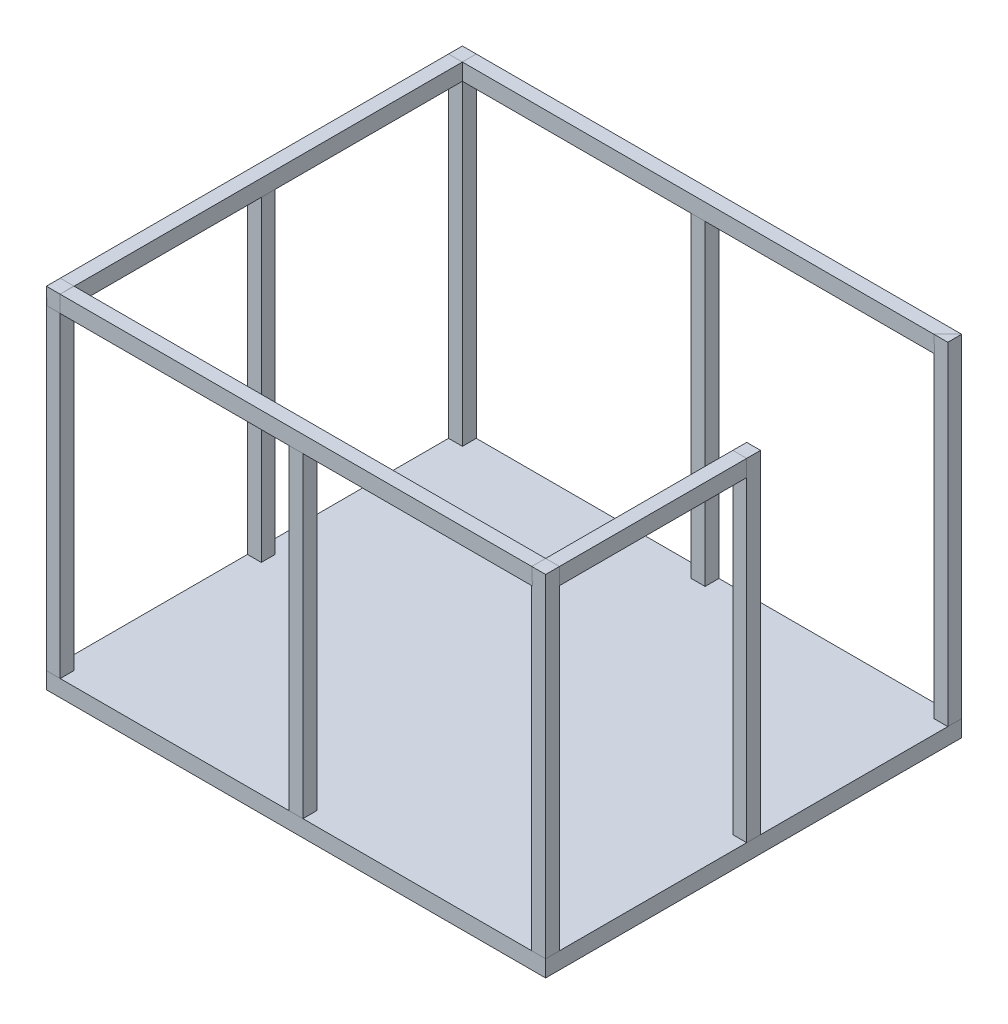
from build123d import *

# Parameters (mm, degrees)
SKETCH_1_W        = 1800
SKETCH_1_H        = 1500
EXTRUDE_1_DEPTH   = 60
SKETCH_2_R        = 210
EXTRUDE_2_DEPTH   = 10
SKETCH_3_W        = 50
SKETCH_3_H        = 50
EXTRUDE_3_DEPTH   = 1200
EXTRUDE_3_2_DEPTH = 1200
EXTRUDE_3_3_DEPTH = 1200
EXTRUDE_3_4_DEPTH = 1200
EXTRUDE_3_5_DEPTH = 1200
EXTRUDE_3_6_DEPTH = 1200
EXTRUDE_3_7_DEPTH = 1200
EXTRUDE_3_8_DEPTH = 1200
SKETCH_4_W        = 50
SKETCH_4_H        = 60
EXTRUDE_5_DEPTH   = 1750
EXTRUDE_5_2_DEPTH = 1750
SKETCH_5_W        = 50
SKETCH_5_H        = 60
EXTRUDE_6_DEPTH   = 1450
SKETCH_6_W        = 50
SKETCH_6_H        = 60
EXTRUDE_7_DEPTH   = 725


with BuildPart() as part:
    # Sketch 1 → Extrude 1 (new body)
    with BuildSketch(Plane(origin=(0, 0, 0), x_dir=(1, 0, 0), z_dir=(0, 1, 0))):
        Rectangle(SKETCH_1_W, SKETCH_1_H)
    extrude(amount=EXTRUDE_1_DEPTH)


with BuildPart() as body_2:
    # Sketch 2 → Extrude 2 (new body)
    with BuildSketch(Plane.XZ):
        with Locations(Location((0, 0, 0), (0, 0, 270))):
            Circle(SKETCH_2_R)
    extrude(amount=EXTRUDE_2_DEPTH)


with BuildPart() as body_3:
    # Sketch 3 → Extrude 3 (new body)
    with BuildSketch(Plane(origin=(0, 60, 0), x_dir=(1, 0, 0), z_dir=(0, 1, 0))):
        with Locations((875, -725)):
            Rectangle(SKETCH_3_W, SKETCH_3_H)
    extrude(amount=EXTRUDE_3_DEPTH)


with BuildPart() as body_4:
    # Sketch 3 → Extrude 3 2 (new body)
    with BuildSketch(Plane(origin=(0, 60, 0), x_dir=(1, 0, 0), z_dir=(0, 1, 0))):
        with Locations((-875, -725)):
            Rectangle(SKETCH_3_W, SKETCH_3_H)
    extrude(amount=EXTRUDE_3_2_DEPTH)


with BuildPart() as body_5:
    # Sketch 3 → Extrude 3 3 (new body)
    with BuildSketch(Plane(origin=(0, 60, 0), x_dir=(1, 0, 0), z_dir=(0, 1, 0))):
        with Locations((875, 725)):
            Rectangle(SKETCH_3_W, SKETCH_3_H)
    extrude(amount=EXTRUDE_3_3_DEPTH)


with BuildPart() as body_6:
    # Sketch 3 → Extrude 3 4 (new body)
    with BuildSketch(Plane(origin=(0, 60, 0), x_dir=(1, 0, 0), z_dir=(0, 1, 0))):
        with Locations((-875, 725)):
            Rectangle(SKETCH_3_W, SKETCH_3_H)
    extrude(amount=EXTRUDE_3_4_DEPTH)


with BuildPart() as body_7:
    # Sketch 3 → Extrude 3 5 (new body)
    with BuildSketch(Plane(origin=(0, 60, 0), x_dir=(1, 0, 0), z_dir=(0, 1, 0))):
        with Locations((875, 0)):
            Rectangle(SKETCH_3_W, SKETCH_3_H)
    extrude(amount=EXTRUDE_3_5_DEPTH)


with BuildPart() as body_8:
    # Sketch 3 → Extrude 3 6 (new body)
    with BuildSketch(Plane(origin=(0, 60, 0), x_dir=(1, 0, 0), z_dir=(0, 1, 0))):
        with Locations((-875, 0)):
            Rectangle(SKETCH_3_W, SKETCH_3_H)
    extrude(amount=EXTRUDE_3_6_DEPTH)


with BuildPart() as body_9:
    # Sketch 3 → Extrude 3 7 (new body)
    with BuildSketch(Plane(origin=(0, 60, 0), x_dir=(1, 0, 0), z_dir=(0, 1, 0))):
        with Locations((0, -725)):
            Rectangle(SKETCH_3_W, SKETCH_3_H)
    extrude(amount=EXTRUDE_3_7_DEPTH)


with BuildPart() as body_10:
    # Sketch 3 → Extrude 3 8 (new body)
    with BuildSketch(Plane(origin=(0, 60, 0), x_dir=(1, 0, 0), z_dir=(0, 1, 0))):
        with Locations((0, 725)):
            Rectangle(SKETCH_3_W, SKETCH_3_H)
    extrude(amount=EXTRUDE_3_8_DEPTH)


with BuildPart() as body_11:
    # Sketch 4 → Extrude 5 (new body)
    with BuildSketch(Plane(origin=(900, 0, 0), x_dir=(0, 0, -1), z_dir=(1, 0, 0))):
        with Locations((-725, 1230)):
            Rectangle(SKETCH_4_W, SKETCH_4_H)
    extrude(amount=-EXTRUDE_5_DEPTH)


with BuildPart() as body_12:
    # Sketch 4 → Extrude 5 2 (new body)
    with BuildSketch(Plane(origin=(900, 0, 0), x_dir=(0, 0, -1), z_dir=(1, 0, 0))):
        with Locations((725, 1230)):
            Rectangle(SKETCH_4_W, SKETCH_4_H)
    extrude(amount=-EXTRUDE_5_2_DEPTH)


with BuildPart() as body_13:
    # Sketch 5 → Extrude 6 (new body)
    with BuildSketch(Plane.XY.offset(750)):
        with Locations((-875, 1230)):
            Rectangle(SKETCH_5_W, SKETCH_5_H)
    extrude(amount=-EXTRUDE_6_DEPTH)


with BuildPart() as body_14:
    # Sketch 6 → Extrude 7 (new body)
    with BuildSketch(Plane.XY.offset(750)):
        with Locations((875, 1230)):
            Rectangle(SKETCH_6_W, SKETCH_6_H)
    extrude(amount=-EXTRUDE_7_DEPTH)


solid = Compound([part.part, body_2.part, body_3.part, body_4.part, body_5.part, body_6.part, body_7.part, body_8.part, body_9.part, body_10.part, body_11.part, body_12.part, body_13.part, body_14.part])
